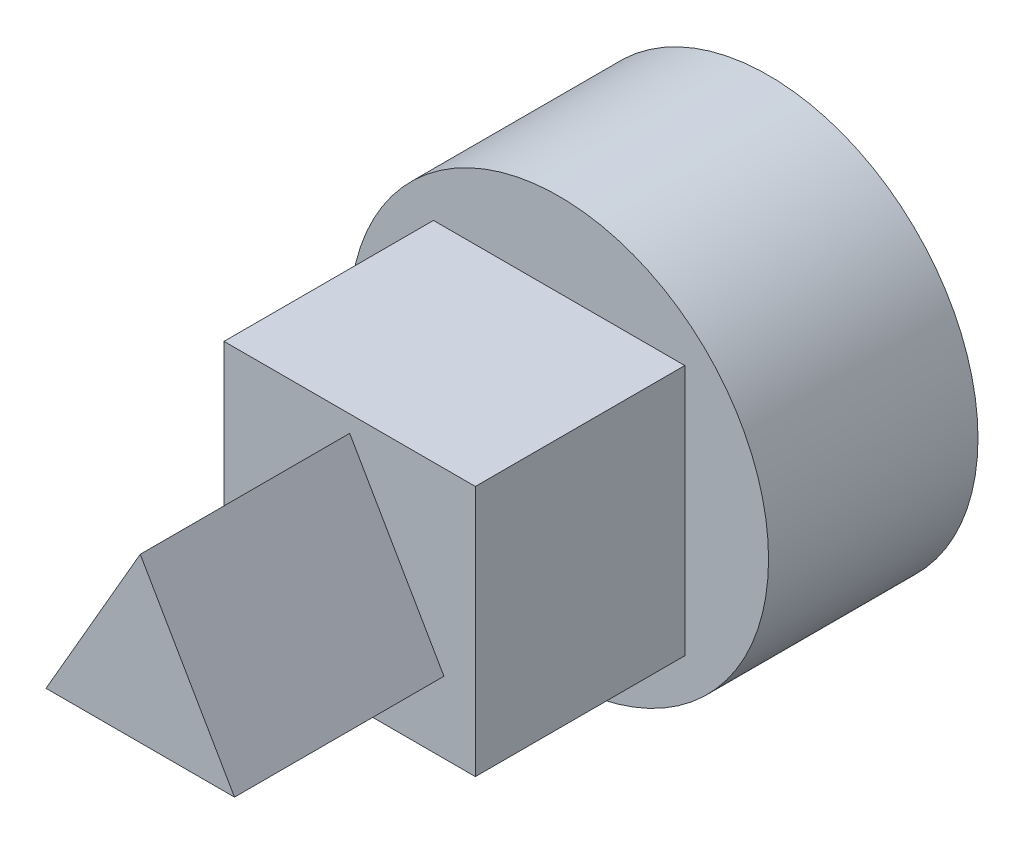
ISO-10303-21;
HEADER;
FILE_DESCRIPTION(('STEP AP214'),'2;1');
FILE_NAME('part.step','',(''),(''),'','','');
FILE_SCHEMA(('AUTOMOTIVE_DESIGN { 1 0 10303 214 1 1 1 1 }'));
ENDSEC;
DATA;
#1=APPLICATION_CONTEXT('core data for automotive mechanical design processes');
#2=APPLICATION_PROTOCOL_DEFINITION('international standard','automotive_design',2000,#1);
#3=PRODUCT_CONTEXT('',#1,'mechanical');
#4=PRODUCT('Part','Part','',(#3));
#5=PRODUCT_RELATED_PRODUCT_CATEGORY('part','',(#4));
#6=PRODUCT_DEFINITION_FORMATION('','',#4);
#7=PRODUCT_DEFINITION_CONTEXT('part definition',#1,'design');
#8=PRODUCT_DEFINITION('design','',#6,#7);
#9=PRODUCT_DEFINITION_SHAPE('','',#8);
#10=(LENGTH_UNIT() NAMED_UNIT(*) SI_UNIT(.MILLI.,.METRE.));
#11=(NAMED_UNIT(*) PLANE_ANGLE_UNIT() SI_UNIT($,.RADIAN.));
#12=(NAMED_UNIT(*) SI_UNIT($,.STERADIAN.) SOLID_ANGLE_UNIT());
#13=UNCERTAINTY_MEASURE_WITH_UNIT(LENGTH_MEASURE(1.E-05),#10,'distance_accuracy_value','');
#14=(GEOMETRIC_REPRESENTATION_CONTEXT(3) GLOBAL_UNCERTAINTY_ASSIGNED_CONTEXT((#13)) GLOBAL_UNIT_ASSIGNED_CONTEXT((#10,
#11,#12)) REPRESENTATION_CONTEXT('',''));
#15=CARTESIAN_POINT('',(0.,0.,0.));
#16=DIRECTION('',(0.,0.,1.));
#17=DIRECTION('',(1.,0.,0.));
#18=AXIS2_PLACEMENT_3D('',#15,#16,#17);
#19=CARTESIAN_POINT('',(0.,-12.9903810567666,150.));
#20=DIRECTION('',(0.,1.,0.));
#21=DIRECTION('',(-1.,0.,0.));
#22=AXIS2_PLACEMENT_3D('',#19,#20,#21);
#23=PLANE('',#22);
#24=DIRECTION('',(0.,0.,-1.));
#25=VECTOR('',#24,1.);
#26=CARTESIAN_POINT('',(-22.5,-12.9903810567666,150.));
#27=LINE('',#26,#25);
#28=CARTESIAN_POINT('',(-22.5,-12.9903810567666,150.));
#29=VERTEX_POINT('',#28);
#30=CARTESIAN_POINT('',(-22.5,-12.9903810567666,100.));
#31=VERTEX_POINT('',#30);
#32=EDGE_CURVE('E128',#29,#31,#27,.T.);
#33=ORIENTED_EDGE('',*,*,#32,.T.);
#34=DIRECTION('',(1.,0.,0.));
#35=VECTOR('',#34,1.);
#36=CARTESIAN_POINT('',(0.,-12.9903810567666,100.));
#37=LINE('',#36,#35);
#38=CARTESIAN_POINT('',(22.5,-12.9903810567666,100.));
#39=VERTEX_POINT('',#38);
#40=EDGE_CURVE('E57',#31,#39,#37,.T.);
#41=ORIENTED_EDGE('',*,*,#40,.T.);
#42=DIRECTION('',(0.,0.,-1.));
#43=VECTOR('',#42,1.);
#44=CARTESIAN_POINT('',(22.5,-12.9903810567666,150.));
#45=LINE('',#44,#43);
#46=CARTESIAN_POINT('',(22.5,-12.9903810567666,150.));
#47=VERTEX_POINT('',#46);
#48=EDGE_CURVE('E11',#47,#39,#45,.T.);
#49=ORIENTED_EDGE('',*,*,#48,.F.);
#50=DIRECTION('',(1.,0.,0.));
#51=VECTOR('',#50,1.);
#52=CARTESIAN_POINT('',(0.,-12.9903810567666,150.));
#53=LINE('',#52,#51);
#54=EDGE_CURVE('E115',#29,#47,#53,.T.);
#55=ORIENTED_EDGE('',*,*,#54,.F.);
#56=EDGE_LOOP('',(#33,#41,#49,#55));
#57=FACE_BOUND('',#56,.T.);
#58=ADVANCED_FACE('F35',(#57),#23,.F.);
#59=CARTESIAN_POINT('',(11.25,6.4951905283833,150.));
#60=DIRECTION('',(-0.866025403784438,-0.5,0.));
#61=DIRECTION('',(0.500000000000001,-0.866025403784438,0.));
#62=AXIS2_PLACEMENT_3D('',#59,#60,#61);
#63=PLANE('',#62);
#64=ORIENTED_EDGE('',*,*,#48,.T.);
#65=DIRECTION('',(-0.500000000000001,0.866025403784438,0.));
#66=VECTOR('',#65,1.);
#67=CARTESIAN_POINT('',(11.25,6.4951905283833,100.));
#68=LINE('',#67,#66);
#69=CARTESIAN_POINT('',(0.,25.9807621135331,100.));
#70=VERTEX_POINT('',#69);
#71=EDGE_CURVE('E140',#39,#70,#68,.T.);
#72=ORIENTED_EDGE('',*,*,#71,.T.);
#73=DIRECTION('',(0.,0.,-1.));
#74=VECTOR('',#73,1.);
#75=CARTESIAN_POINT('',(0.,25.9807621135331,150.));
#76=LINE('',#75,#74);
#77=CARTESIAN_POINT('',(0.,25.9807621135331,150.));
#78=VERTEX_POINT('',#77);
#79=EDGE_CURVE('E42',#78,#70,#76,.T.);
#80=ORIENTED_EDGE('',*,*,#79,.F.);
#81=DIRECTION('',(-0.500000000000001,0.866025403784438,0.));
#82=VECTOR('',#81,1.);
#83=CARTESIAN_POINT('',(11.25,6.4951905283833,150.));
#84=LINE('',#83,#82);
#85=EDGE_CURVE('E119',#47,#78,#84,.T.);
#86=ORIENTED_EDGE('',*,*,#85,.F.);
#87=EDGE_LOOP('',(#64,#72,#80,#86));
#88=FACE_BOUND('',#87,.T.);
#89=ADVANCED_FACE('F139',(#88),#63,.F.);
#90=CARTESIAN_POINT('',(-11.25,6.49519052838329,150.));
#91=DIRECTION('',(0.866025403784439,-0.5,0.));
#92=DIRECTION('',(0.5,0.866025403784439,0.));
#93=AXIS2_PLACEMENT_3D('',#90,#91,#92);
#94=PLANE('',#93);
#95=ORIENTED_EDGE('',*,*,#79,.T.);
#96=DIRECTION('',(-0.5,-0.866025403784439,0.));
#97=VECTOR('',#96,1.);
#98=CARTESIAN_POINT('',(-11.25,6.49519052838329,100.));
#99=LINE('',#98,#97);
#100=EDGE_CURVE('E136',#70,#31,#99,.T.);
#101=ORIENTED_EDGE('',*,*,#100,.T.);
#102=ORIENTED_EDGE('',*,*,#32,.F.);
#103=DIRECTION('',(-0.5,-0.866025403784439,0.));
#104=VECTOR('',#103,1.);
#105=CARTESIAN_POINT('',(-11.25,6.49519052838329,150.));
#106=LINE('',#105,#104);
#107=EDGE_CURVE('E126',#78,#29,#106,.T.);
#108=ORIENTED_EDGE('',*,*,#107,.F.);
#109=EDGE_LOOP('',(#95,#101,#102,#108));
#110=FACE_BOUND('',#109,.T.);
#111=ADVANCED_FACE('F134',(#110),#94,.F.);
#112=CARTESIAN_POINT('',(0.,0.,150.));
#113=DIRECTION('',(0.,0.,1.));
#114=DIRECTION('',(1.,0.,0.));
#115=AXIS2_PLACEMENT_3D('',#112,#113,#114);
#116=PLANE('',#115);
#117=ORIENTED_EDGE('',*,*,#54,.T.);
#118=ORIENTED_EDGE('',*,*,#85,.T.);
#119=ORIENTED_EDGE('',*,*,#107,.T.);
#120=EDGE_LOOP('',(#117,#118,#119));
#121=FACE_BOUND('',#120,.T.);
#122=ADVANCED_FACE('F186',(#121),#116,.T.);
#123=CARTESIAN_POINT('',(-30.,0.,100.));
#124=DIRECTION('',(-1.,0.,0.));
#125=DIRECTION('',(0.,0.,1.));
#126=AXIS2_PLACEMENT_3D('',#123,#124,#125);
#127=PLANE('',#126);
#128=DIRECTION('',(0.,1.,0.));
#129=VECTOR('',#128,1.);
#130=CARTESIAN_POINT('',(-30.,0.,50.));
#131=LINE('',#130,#129);
#132=CARTESIAN_POINT('',(-30.,-30.,50.));
#133=VERTEX_POINT('',#132);
#134=CARTESIAN_POINT('',(-30.,30.,50.));
#135=VERTEX_POINT('',#134);
#136=EDGE_CURVE('E49',#133,#135,#131,.T.);
#137=ORIENTED_EDGE('',*,*,#136,.F.);
#138=DIRECTION('',(0.,0.,-1.));
#139=VECTOR('',#138,1.);
#140=CARTESIAN_POINT('',(-30.,-30.,100.));
#141=LINE('',#140,#139);
#142=CARTESIAN_POINT('',(-30.,-30.,100.));
#143=VERTEX_POINT('',#142);
#144=EDGE_CURVE('E105',#143,#133,#141,.T.);
#145=ORIENTED_EDGE('',*,*,#144,.F.);
#146=DIRECTION('',(0.,1.,0.));
#147=VECTOR('',#146,1.);
#148=CARTESIAN_POINT('',(-30.,0.,100.));
#149=LINE('',#148,#147);
#150=CARTESIAN_POINT('',(-30.,30.,100.));
#151=VERTEX_POINT('',#150);
#152=EDGE_CURVE('E150',#143,#151,#149,.T.);
#153=ORIENTED_EDGE('',*,*,#152,.T.);
#154=DIRECTION('',(0.,0.,-1.));
#155=VECTOR('',#154,1.);
#156=CARTESIAN_POINT('',(-30.,30.,100.));
#157=LINE('',#156,#155);
#158=EDGE_CURVE('E108',#151,#135,#157,.T.);
#159=ORIENTED_EDGE('',*,*,#158,.T.);
#160=EDGE_LOOP('',(#137,#145,#153,#159));
#161=FACE_BOUND('',#160,.T.);
#162=ADVANCED_FACE('F103',(#161),#127,.T.);
#163=CARTESIAN_POINT('',(0.,-30.,100.));
#164=DIRECTION('',(0.,-1.,0.));
#165=DIRECTION('',(1.,0.,0.));
#166=AXIS2_PLACEMENT_3D('',#163,#164,#165);
#167=PLANE('',#166);
#168=DIRECTION('',(-1.,0.,0.));
#169=VECTOR('',#168,1.);
#170=CARTESIAN_POINT('',(0.,-30.,50.));
#171=LINE('',#170,#169);
#172=CARTESIAN_POINT('',(30.,-30.,50.));
#173=VERTEX_POINT('',#172);
#174=EDGE_CURVE('E91',#173,#133,#171,.T.);
#175=ORIENTED_EDGE('',*,*,#174,.F.);
#176=DIRECTION('',(0.,0.,-1.));
#177=VECTOR('',#176,1.);
#178=CARTESIAN_POINT('',(30.,-30.,100.));
#179=LINE('',#178,#177);
#180=CARTESIAN_POINT('',(30.,-30.,100.));
#181=VERTEX_POINT('',#180);
#182=EDGE_CURVE('E116',#181,#173,#179,.T.);
#183=ORIENTED_EDGE('',*,*,#182,.F.);
#184=DIRECTION('',(-1.,0.,0.));
#185=VECTOR('',#184,1.);
#186=CARTESIAN_POINT('',(0.,-30.,100.));
#187=LINE('',#186,#185);
#188=EDGE_CURVE('E114',#181,#143,#187,.T.);
#189=ORIENTED_EDGE('',*,*,#188,.T.);
#190=ORIENTED_EDGE('',*,*,#144,.T.);
#191=EDGE_LOOP('',(#175,#183,#189,#190));
#192=FACE_BOUND('',#191,.T.);
#193=ADVANCED_FACE('F112',(#192),#167,.T.);
#194=CARTESIAN_POINT('',(30.,0.,100.));
#195=DIRECTION('',(-1.,0.,0.));
#196=DIRECTION('',(0.,0.,1.));
#197=AXIS2_PLACEMENT_3D('',#194,#195,#196);
#198=PLANE('',#197);
#199=ORIENTED_EDGE('',*,*,#182,.T.);
#200=DIRECTION('',(0.,1.,0.));
#201=VECTOR('',#200,1.);
#202=CARTESIAN_POINT('',(30.,0.,50.));
#203=LINE('',#202,#201);
#204=CARTESIAN_POINT('',(30.,30.,50.));
#205=VERTEX_POINT('',#204);
#206=EDGE_CURVE('E95',#173,#205,#203,.T.);
#207=ORIENTED_EDGE('',*,*,#206,.T.);
#208=DIRECTION('',(0.,0.,-1.));
#209=VECTOR('',#208,1.);
#210=CARTESIAN_POINT('',(30.,30.,100.));
#211=LINE('',#210,#209);
#212=CARTESIAN_POINT('',(30.,30.,100.));
#213=VERTEX_POINT('',#212);
#214=EDGE_CURVE('E121',#213,#205,#211,.T.);
#215=ORIENTED_EDGE('',*,*,#214,.F.);
#216=DIRECTION('',(0.,1.,0.));
#217=VECTOR('',#216,1.);
#218=CARTESIAN_POINT('',(30.,0.,100.));
#219=LINE('',#218,#217);
#220=EDGE_CURVE('E153',#181,#213,#219,.T.);
#221=ORIENTED_EDGE('',*,*,#220,.F.);
#222=EDGE_LOOP('',(#199,#207,#215,#221));
#223=FACE_BOUND('',#222,.T.);
#224=ADVANCED_FACE('F164',(#223),#198,.F.);
#225=CARTESIAN_POINT('',(0.,30.,100.));
#226=DIRECTION('',(0.,-1.,0.));
#227=DIRECTION('',(1.,0.,0.));
#228=AXIS2_PLACEMENT_3D('',#225,#226,#227);
#229=PLANE('',#228);
#230=ORIENTED_EDGE('',*,*,#214,.T.);
#231=DIRECTION('',(-1.,0.,0.));
#232=VECTOR('',#231,1.);
#233=CARTESIAN_POINT('',(0.,30.,50.));
#234=LINE('',#233,#232);
#235=EDGE_CURVE('E109',#205,#135,#234,.T.);
#236=ORIENTED_EDGE('',*,*,#235,.T.);
#237=ORIENTED_EDGE('',*,*,#158,.F.);
#238=DIRECTION('',(-1.,0.,0.));
#239=VECTOR('',#238,1.);
#240=CARTESIAN_POINT('',(0.,30.,100.));
#241=LINE('',#240,#239);
#242=EDGE_CURVE('E156',#213,#151,#241,.T.);
#243=ORIENTED_EDGE('',*,*,#242,.F.);
#244=EDGE_LOOP('',(#230,#236,#237,#243));
#245=FACE_BOUND('',#244,.T.);
#246=ADVANCED_FACE('F161',(#245),#229,.F.);
#247=CARTESIAN_POINT('',(0.,0.,100.));
#248=DIRECTION('',(0.,0.,1.));
#249=DIRECTION('',(1.,0.,0.));
#250=AXIS2_PLACEMENT_3D('',#247,#248,#249);
#251=PLANE('',#250);
#252=ORIENTED_EDGE('',*,*,#71,.F.);
#253=ORIENTED_EDGE('',*,*,#40,.F.);
#254=ORIENTED_EDGE('',*,*,#100,.F.);
#255=EDGE_LOOP('',(#252,#253,#254));
#256=FACE_BOUND('',#255,.T.);
#257=ORIENTED_EDGE('',*,*,#152,.F.);
#258=ORIENTED_EDGE('',*,*,#188,.F.);
#259=ORIENTED_EDGE('',*,*,#220,.T.);
#260=ORIENTED_EDGE('',*,*,#242,.T.);
#261=EDGE_LOOP('',(#257,#258,#259,#260));
#262=FACE_BOUND('',#261,.T.);
#263=ADVANCED_FACE('F168',(#256,#262),#251,.T.);
#264=CARTESIAN_POINT('',(0.,0.,50.));
#265=DIRECTION('',(0.,0.,-1.));
#266=DIRECTION('',(-1.,0.,0.));
#267=AXIS2_PLACEMENT_3D('',#264,#265,#266);
#268=CYLINDRICAL_SURFACE('',#267,50.);
#269=CARTESIAN_POINT('',(0.,0.,50.));
#270=DIRECTION('',(0.,0.,1.));
#271=DIRECTION('',(1.,0.,0.));
#272=AXIS2_PLACEMENT_3D('',#269,#270,#271);
#273=CIRCLE('',#272,50.);
#274=CARTESIAN_POINT('',(50.,0.,50.));
#275=VERTEX_POINT('',#274);
#276=EDGE_CURVE('E142',#275,#275,#273,.T.);
#277=ORIENTED_EDGE('',*,*,#276,.F.);
#278=EDGE_LOOP('',(#277));
#279=FACE_BOUND('',#278,.T.);
#280=CARTESIAN_POINT('',(0.,0.,0.));
#281=DIRECTION('',(0.,0.,1.));
#282=DIRECTION('',(1.,0.,0.));
#283=AXIS2_PLACEMENT_3D('',#280,#281,#282);
#284=CIRCLE('',#283,50.);
#285=CARTESIAN_POINT('',(50.,0.,0.));
#286=VERTEX_POINT('',#285);
#287=EDGE_CURVE('E99',#286,#286,#284,.T.);
#288=ORIENTED_EDGE('',*,*,#287,.T.);
#289=EDGE_LOOP('',(#288));
#290=FACE_BOUND('',#289,.T.);
#291=ADVANCED_FACE('F170',(#279,#290),#268,.T.);
#292=CARTESIAN_POINT('',(0.,0.,50.));
#293=DIRECTION('',(0.,0.,1.));
#294=DIRECTION('',(1.,0.,0.));
#295=AXIS2_PLACEMENT_3D('',#292,#293,#294);
#296=PLANE('',#295);
#297=ORIENTED_EDGE('',*,*,#174,.T.);
#298=ORIENTED_EDGE('',*,*,#136,.T.);
#299=ORIENTED_EDGE('',*,*,#235,.F.);
#300=ORIENTED_EDGE('',*,*,#206,.F.);
#301=EDGE_LOOP('',(#297,#298,#299,#300));
#302=FACE_BOUND('',#301,.T.);
#303=ORIENTED_EDGE('',*,*,#276,.T.);
#304=EDGE_LOOP('',(#303));
#305=FACE_BOUND('',#304,.T.);
#306=ADVANCED_FACE('F92',(#302,#305),#296,.T.);
#307=CARTESIAN_POINT('',(0.,0.,0.));
#308=DIRECTION('',(0.,0.,1.));
#309=DIRECTION('',(1.,0.,0.));
#310=AXIS2_PLACEMENT_3D('',#307,#308,#309);
#311=PLANE('',#310);
#312=ORIENTED_EDGE('',*,*,#287,.F.);
#313=EDGE_LOOP('',(#312));
#314=FACE_BOUND('',#313,.T.);
#315=ADVANCED_FACE('F197',(#314),#311,.F.);
#316=CLOSED_SHELL('',(#58,#89,#111,#122,#162,#193,#224,#246,#263,#291,#306,#315));
#317=MANIFOLD_SOLID_BREP('B2',#316);
#318=ADVANCED_BREP_SHAPE_REPRESENTATION('',(#18,#317),#14);
#319=SHAPE_DEFINITION_REPRESENTATION(#9,#318);
ENDSEC;
END-ISO-10303-21;
